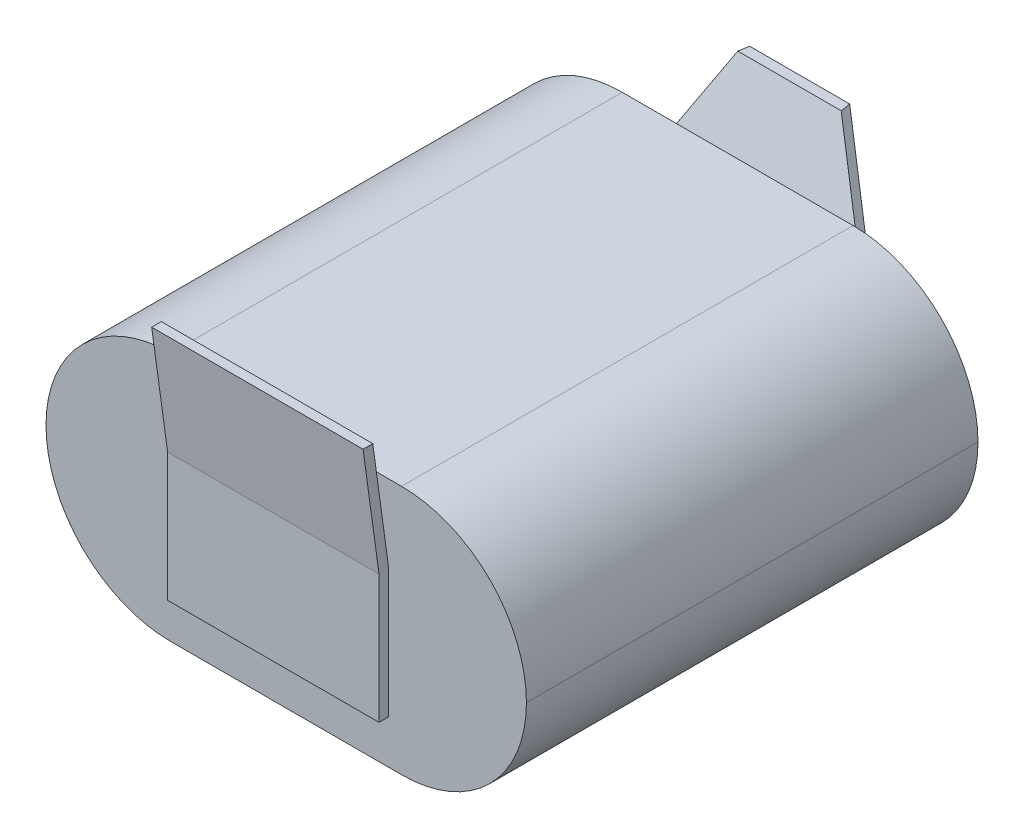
ISO-10303-21;
HEADER;
FILE_DESCRIPTION(('STEP AP214'),'2;1');
FILE_NAME('part.step','',(''),(''),'','','');
FILE_SCHEMA(('AUTOMOTIVE_DESIGN { 1 0 10303 214 1 1 1 1 }'));
ENDSEC;
DATA;
#1=APPLICATION_CONTEXT('core data for automotive mechanical design processes');
#2=APPLICATION_PROTOCOL_DEFINITION('international standard','automotive_design',2000,#1);
#3=PRODUCT_CONTEXT('',#1,'mechanical');
#4=PRODUCT('Part','Part','',(#3));
#5=PRODUCT_RELATED_PRODUCT_CATEGORY('part','',(#4));
#6=PRODUCT_DEFINITION_FORMATION('','',#4);
#7=PRODUCT_DEFINITION_CONTEXT('part definition',#1,'design');
#8=PRODUCT_DEFINITION('design','',#6,#7);
#9=PRODUCT_DEFINITION_SHAPE('','',#8);
#10=(LENGTH_UNIT() NAMED_UNIT(*) SI_UNIT(.MILLI.,.METRE.));
#11=(NAMED_UNIT(*) PLANE_ANGLE_UNIT() SI_UNIT($,.RADIAN.));
#12=(NAMED_UNIT(*) SI_UNIT($,.STERADIAN.) SOLID_ANGLE_UNIT());
#13=UNCERTAINTY_MEASURE_WITH_UNIT(LENGTH_MEASURE(1.E-05),#10,'distance_accuracy_value','');
#14=(GEOMETRIC_REPRESENTATION_CONTEXT(3) GLOBAL_UNCERTAINTY_ASSIGNED_CONTEXT((#13)) GLOBAL_UNIT_ASSIGNED_CONTEXT((#10,
#11,#12)) REPRESENTATION_CONTEXT('',''));
#15=CARTESIAN_POINT('',(0.,0.,0.));
#16=DIRECTION('',(0.,0.,1.));
#17=DIRECTION('',(1.,0.,0.));
#18=AXIS2_PLACEMENT_3D('',#15,#16,#17);
#19=CARTESIAN_POINT('',(3.17090192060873,-14.1,-23.5));
#20=DIRECTION('',(0.,0.,1.));
#21=DIRECTION('',(1.,0.,0.));
#22=AXIS2_PLACEMENT_3D('',#19,#20,#21);
#23=CYLINDRICAL_SURFACE('',#22,6.5);
#24=CARTESIAN_POINT('',(3.17090192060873,-14.1,0.));
#25=DIRECTION('',(0.,0.,1.));
#26=DIRECTION('',(1.,0.,0.));
#27=AXIS2_PLACEMENT_3D('',#24,#25,#26);
#28=CIRCLE('',#27,6.5);
#29=CARTESIAN_POINT('',(9.67090192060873,-14.1,0.));
#30=VERTEX_POINT('',#29);
#31=CARTESIAN_POINT('',(3.17090192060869,-7.6,0.));
#32=VERTEX_POINT('',#31);
#33=EDGE_CURVE('E274',#30,#32,#28,.T.);
#34=ORIENTED_EDGE('',*,*,#33,.F.);
#35=DIRECTION('',(0.,0.,1.));
#36=VECTOR('',#35,1.);
#37=CARTESIAN_POINT('',(9.67090192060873,-14.1,-23.5));
#38=LINE('',#37,#36);
#39=CARTESIAN_POINT('',(9.67090192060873,-14.1,-23.5));
#40=VERTEX_POINT('',#39);
#41=EDGE_CURVE('E11',#40,#30,#38,.T.);
#42=ORIENTED_EDGE('',*,*,#41,.F.);
#43=CARTESIAN_POINT('',(3.17090192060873,-14.1,-23.5));
#44=DIRECTION('',(0.,0.,1.));
#45=DIRECTION('',(1.,0.,0.));
#46=AXIS2_PLACEMENT_3D('',#43,#44,#45);
#47=CIRCLE('',#46,6.5);
#48=CARTESIAN_POINT('',(3.17090192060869,-7.6,-23.5));
#49=VERTEX_POINT('',#48);
#50=EDGE_CURVE('E275',#40,#49,#47,.T.);
#51=ORIENTED_EDGE('',*,*,#50,.T.);
#52=DIRECTION('',(0.,0.,1.));
#53=VECTOR('',#52,1.);
#54=CARTESIAN_POINT('',(3.17090192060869,-7.6,-23.5));
#55=LINE('',#54,#53);
#56=EDGE_CURVE('E35',#49,#32,#55,.T.);
#57=ORIENTED_EDGE('',*,*,#56,.T.);
#58=EDGE_LOOP('',(#34,#42,#51,#57));
#59=FACE_BOUND('',#58,.T.);
#60=ADVANCED_FACE('F32',(#59),#23,.T.);
#61=CARTESIAN_POINT('',(9.67090192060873,-14.11,-23.5));
#62=DIRECTION('',(1.,0.,0.));
#63=DIRECTION('',(0.,0.,-1.));
#64=AXIS2_PLACEMENT_3D('',#61,#62,#63);
#65=PLANE('',#64);
#66=DIRECTION('',(0.,1.,0.));
#67=VECTOR('',#66,1.);
#68=CARTESIAN_POINT('',(9.67090192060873,-14.11,0.));
#69=LINE('',#68,#67);
#70=CARTESIAN_POINT('',(9.67090192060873,-14.11,0.));
#71=VERTEX_POINT('',#70);
#72=EDGE_CURVE('E279',#71,#30,#69,.T.);
#73=ORIENTED_EDGE('',*,*,#72,.F.);
#74=DIRECTION('',(0.,0.,1.));
#75=VECTOR('',#74,1.);
#76=CARTESIAN_POINT('',(9.67090192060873,-14.11,-23.5));
#77=LINE('',#76,#75);
#78=CARTESIAN_POINT('',(9.67090192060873,-14.11,-23.5));
#79=VERTEX_POINT('',#78);
#80=EDGE_CURVE('E40',#79,#71,#77,.T.);
#81=ORIENTED_EDGE('',*,*,#80,.F.);
#82=DIRECTION('',(0.,1.,0.));
#83=VECTOR('',#82,1.);
#84=CARTESIAN_POINT('',(9.67090192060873,-14.11,-23.5));
#85=LINE('',#84,#83);
#86=EDGE_CURVE('E297',#79,#40,#85,.T.);
#87=ORIENTED_EDGE('',*,*,#86,.T.);
#88=ORIENTED_EDGE('',*,*,#41,.T.);
#89=EDGE_LOOP('',(#73,#81,#87,#88));
#90=FACE_BOUND('',#89,.T.);
#91=ADVANCED_FACE('F344',(#90),#65,.T.);
#92=CARTESIAN_POINT('',(3.18090192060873,-14.11,-23.5));
#93=DIRECTION('',(0.,0.,1.));
#94=DIRECTION('',(1.,0.,0.));
#95=AXIS2_PLACEMENT_3D('',#92,#93,#94);
#96=CYLINDRICAL_SURFACE('',#95,6.49);
#97=CARTESIAN_POINT('',(3.18090192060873,-14.11,0.));
#98=DIRECTION('',(0.,0.,1.));
#99=DIRECTION('',(1.,0.,0.));
#100=AXIS2_PLACEMENT_3D('',#97,#98,#99);
#101=CIRCLE('',#100,6.49);
#102=CARTESIAN_POINT('',(3.18090192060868,-20.6,0.));
#103=VERTEX_POINT('',#102);
#104=EDGE_CURVE('E317',#103,#71,#101,.T.);
#105=ORIENTED_EDGE('',*,*,#104,.F.);
#106=DIRECTION('',(0.,0.,1.));
#107=VECTOR('',#106,1.);
#108=CARTESIAN_POINT('',(3.18090192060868,-20.6,-23.5));
#109=LINE('',#108,#107);
#110=CARTESIAN_POINT('',(3.18090192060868,-20.6,-23.5));
#111=VERTEX_POINT('',#110);
#112=EDGE_CURVE('E323',#111,#103,#109,.T.);
#113=ORIENTED_EDGE('',*,*,#112,.F.);
#114=CARTESIAN_POINT('',(3.18090192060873,-14.11,-23.5));
#115=DIRECTION('',(0.,0.,1.));
#116=DIRECTION('',(1.,0.,0.));
#117=AXIS2_PLACEMENT_3D('',#114,#115,#116);
#118=CIRCLE('',#117,6.49);
#119=EDGE_CURVE('E294',#111,#79,#118,.T.);
#120=ORIENTED_EDGE('',*,*,#119,.T.);
#121=ORIENTED_EDGE('',*,*,#80,.T.);
#122=EDGE_LOOP('',(#105,#113,#120,#121));
#123=FACE_BOUND('',#122,.T.);
#124=ADVANCED_FACE('F365',(#123),#96,.T.);
#125=CARTESIAN_POINT('',(-8.82909807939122,-20.6,-23.5));
#126=DIRECTION('',(0.,-1.,0.));
#127=DIRECTION('',(0.,0.,-1.));
#128=AXIS2_PLACEMENT_3D('',#125,#126,#127);
#129=PLANE('',#128);
#130=DIRECTION('',(1.,0.,0.));
#131=VECTOR('',#130,1.);
#132=CARTESIAN_POINT('',(-8.82909807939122,-20.6,0.));
#133=LINE('',#132,#131);
#134=CARTESIAN_POINT('',(-8.82909807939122,-20.6,0.));
#135=VERTEX_POINT('',#134);
#136=EDGE_CURVE('E314',#135,#103,#133,.T.);
#137=ORIENTED_EDGE('',*,*,#136,.F.);
#138=DIRECTION('',(0.,0.,1.));
#139=VECTOR('',#138,1.);
#140=CARTESIAN_POINT('',(-8.82909807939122,-20.6,-23.5));
#141=LINE('',#140,#139);
#142=CARTESIAN_POINT('',(-8.82909807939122,-20.6,-23.5));
#143=VERTEX_POINT('',#142);
#144=EDGE_CURVE('E325',#143,#135,#141,.T.);
#145=ORIENTED_EDGE('',*,*,#144,.F.);
#146=DIRECTION('',(1.,0.,0.));
#147=VECTOR('',#146,1.);
#148=CARTESIAN_POINT('',(-8.82909807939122,-20.6,-23.5));
#149=LINE('',#148,#147);
#150=EDGE_CURVE('E291',#143,#111,#149,.T.);
#151=ORIENTED_EDGE('',*,*,#150,.T.);
#152=ORIENTED_EDGE('',*,*,#112,.T.);
#153=EDGE_LOOP('',(#137,#145,#151,#152));
#154=FACE_BOUND('',#153,.T.);
#155=ADVANCED_FACE('F363',(#154),#129,.T.);
#156=CARTESIAN_POINT('',(-8.82909807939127,-14.1,-23.5));
#157=DIRECTION('',(0.,0.,1.));
#158=DIRECTION('',(1.,0.,0.));
#159=AXIS2_PLACEMENT_3D('',#156,#157,#158);
#160=CYLINDRICAL_SURFACE('',#159,6.5);
#161=CARTESIAN_POINT('',(-8.82909807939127,-14.1,0.));
#162=DIRECTION('',(0.,0.,1.));
#163=DIRECTION('',(1.,0.,0.));
#164=AXIS2_PLACEMENT_3D('',#161,#162,#163);
#165=CIRCLE('',#164,6.5);
#166=CARTESIAN_POINT('',(-15.3290980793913,-14.1,0.));
#167=VERTEX_POINT('',#166);
#168=EDGE_CURVE('E311',#167,#135,#165,.T.);
#169=ORIENTED_EDGE('',*,*,#168,.F.);
#170=DIRECTION('',(0.,0.,1.));
#171=VECTOR('',#170,1.);
#172=CARTESIAN_POINT('',(-15.3290980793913,-14.1,-23.5));
#173=LINE('',#172,#171);
#174=CARTESIAN_POINT('',(-15.3290980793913,-14.1,-23.5));
#175=VERTEX_POINT('',#174);
#176=EDGE_CURVE('E327',#175,#167,#173,.T.);
#177=ORIENTED_EDGE('',*,*,#176,.F.);
#178=CARTESIAN_POINT('',(-8.82909807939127,-14.1,-23.5));
#179=DIRECTION('',(0.,0.,1.));
#180=DIRECTION('',(1.,0.,0.));
#181=AXIS2_PLACEMENT_3D('',#178,#179,#180);
#182=CIRCLE('',#181,6.5);
#183=EDGE_CURVE('E288',#175,#143,#182,.T.);
#184=ORIENTED_EDGE('',*,*,#183,.T.);
#185=ORIENTED_EDGE('',*,*,#144,.T.);
#186=EDGE_LOOP('',(#169,#177,#184,#185));
#187=FACE_BOUND('',#186,.T.);
#188=ADVANCED_FACE('F359',(#187),#160,.T.);
#189=CARTESIAN_POINT('',(-15.3290980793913,-14.1,-23.5));
#190=DIRECTION('',(-1.,0.,0.));
#191=DIRECTION('',(0.,0.,1.));
#192=AXIS2_PLACEMENT_3D('',#189,#190,#191);
#193=PLANE('',#192);
#194=DIRECTION('',(0.,-1.,0.));
#195=VECTOR('',#194,1.);
#196=CARTESIAN_POINT('',(-15.3290980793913,-14.1,0.));
#197=LINE('',#196,#195);
#198=CARTESIAN_POINT('',(-15.3290980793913,-14.09,0.));
#199=VERTEX_POINT('',#198);
#200=EDGE_CURVE('E308',#199,#167,#197,.T.);
#201=ORIENTED_EDGE('',*,*,#200,.F.);
#202=DIRECTION('',(0.,0.,1.));
#203=VECTOR('',#202,1.);
#204=CARTESIAN_POINT('',(-15.3290980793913,-14.09,-23.5));
#205=LINE('',#204,#203);
#206=CARTESIAN_POINT('',(-15.3290980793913,-14.09,-23.5));
#207=VERTEX_POINT('',#206);
#208=EDGE_CURVE('E329',#207,#199,#205,.T.);
#209=ORIENTED_EDGE('',*,*,#208,.F.);
#210=DIRECTION('',(0.,-1.,0.));
#211=VECTOR('',#210,1.);
#212=CARTESIAN_POINT('',(-15.3290980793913,-14.1,-23.5));
#213=LINE('',#212,#211);
#214=EDGE_CURVE('E285',#207,#175,#213,.T.);
#215=ORIENTED_EDGE('',*,*,#214,.T.);
#216=ORIENTED_EDGE('',*,*,#176,.T.);
#217=EDGE_LOOP('',(#201,#209,#215,#216));
#218=FACE_BOUND('',#217,.T.);
#219=ADVANCED_FACE('F357',(#218),#193,.T.);
#220=CARTESIAN_POINT('',(-8.83909807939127,-14.09,-23.5));
#221=DIRECTION('',(0.,0.,1.));
#222=DIRECTION('',(1.,0.,0.));
#223=AXIS2_PLACEMENT_3D('',#220,#221,#222);
#224=CYLINDRICAL_SURFACE('',#223,6.49);
#225=CARTESIAN_POINT('',(-8.83909807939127,-14.09,0.));
#226=DIRECTION('',(0.,0.,1.));
#227=DIRECTION('',(1.,0.,0.));
#228=AXIS2_PLACEMENT_3D('',#225,#226,#227);
#229=CIRCLE('',#228,6.49);
#230=CARTESIAN_POINT('',(-8.83909807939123,-7.6,0.));
#231=VERTEX_POINT('',#230);
#232=EDGE_CURVE('E305',#231,#199,#229,.T.);
#233=ORIENTED_EDGE('',*,*,#232,.F.);
#234=DIRECTION('',(0.,0.,1.));
#235=VECTOR('',#234,1.);
#236=CARTESIAN_POINT('',(-8.83909807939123,-7.6,-23.5));
#237=LINE('',#236,#235);
#238=CARTESIAN_POINT('',(-8.83909807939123,-7.6,-23.5));
#239=VERTEX_POINT('',#238);
#240=EDGE_CURVE('E330',#239,#231,#237,.T.);
#241=ORIENTED_EDGE('',*,*,#240,.F.);
#242=CARTESIAN_POINT('',(-8.83909807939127,-14.09,-23.5));
#243=DIRECTION('',(0.,0.,1.));
#244=DIRECTION('',(1.,0.,0.));
#245=AXIS2_PLACEMENT_3D('',#242,#243,#244);
#246=CIRCLE('',#245,6.49);
#247=EDGE_CURVE('E282',#239,#207,#246,.T.);
#248=ORIENTED_EDGE('',*,*,#247,.T.);
#249=ORIENTED_EDGE('',*,*,#208,.T.);
#250=EDGE_LOOP('',(#233,#241,#248,#249));
#251=FACE_BOUND('',#250,.T.);
#252=ADVANCED_FACE('F353',(#251),#224,.T.);
#253=CARTESIAN_POINT('',(-8.83909807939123,-7.6,-23.5));
#254=DIRECTION('',(0.,1.,0.));
#255=DIRECTION('',(0.,0.,1.));
#256=AXIS2_PLACEMENT_3D('',#253,#254,#255);
#257=PLANE('',#256);
#258=DIRECTION('',(-1.,0.,0.));
#259=VECTOR('',#258,1.);
#260=CARTESIAN_POINT('',(-8.83909807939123,-7.6,0.));
#261=LINE('',#260,#259);
#262=EDGE_CURVE('E302',#32,#231,#261,.T.);
#263=ORIENTED_EDGE('',*,*,#262,.F.);
#264=ORIENTED_EDGE('',*,*,#56,.F.);
#265=DIRECTION('',(-1.,0.,0.));
#266=VECTOR('',#265,1.);
#267=CARTESIAN_POINT('',(-8.83909807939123,-7.6,-23.5));
#268=LINE('',#267,#266);
#269=EDGE_CURVE('E278',#49,#239,#268,.T.);
#270=ORIENTED_EDGE('',*,*,#269,.T.);
#271=ORIENTED_EDGE('',*,*,#240,.T.);
#272=EDGE_LOOP('',(#263,#264,#270,#271));
#273=FACE_BOUND('',#272,.T.);
#274=ADVANCED_FACE('F338',(#273),#257,.T.);
#275=CARTESIAN_POINT('',(3.17090192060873,-14.1,-23.5));
#276=DIRECTION('',(0.,0.,1.));
#277=DIRECTION('',(1.,0.,0.));
#278=AXIS2_PLACEMENT_3D('',#275,#276,#277);
#279=PLANE('',#278);
#280=DIRECTION('',(-1.,0.,0.));
#281=VECTOR('',#280,1.);
#282=CARTESIAN_POINT('',(2.5,-18.3247245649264,-23.5));
#283=LINE('',#282,#281);
#284=CARTESIAN_POINT('',(2.5,-18.3247245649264,-23.5));
#285=VERTEX_POINT('',#284);
#286=CARTESIAN_POINT('',(-8.5,-18.3247245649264,-23.5));
#287=VERTEX_POINT('',#286);
#288=EDGE_CURVE('E227',#285,#287,#283,.T.);
#289=ORIENTED_EDGE('',*,*,#288,.F.);
#290=DIRECTION('',(0.,-1.,0.));
#291=VECTOR('',#290,1.);
#292=CARTESIAN_POINT('',(2.5,-18.3247245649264,-23.5));
#293=LINE('',#292,#291);
#294=CARTESIAN_POINT('',(2.5,-14.0273890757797,-23.5));
#295=VERTEX_POINT('',#294);
#296=EDGE_CURVE('E204',#295,#285,#293,.T.);
#297=ORIENTED_EDGE('',*,*,#296,.F.);
#298=DIRECTION('',(-1.,0.,0.));
#299=VECTOR('',#298,1.);
#300=CARTESIAN_POINT('',(2.5,-14.0273890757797,-23.5));
#301=LINE('',#300,#299);
#302=CARTESIAN_POINT('',(-8.5,-14.0273890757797,-23.5));
#303=VERTEX_POINT('',#302);
#304=EDGE_CURVE('E214',#295,#303,#301,.T.);
#305=ORIENTED_EDGE('',*,*,#304,.T.);
#306=DIRECTION('',(0.,-1.,0.));
#307=VECTOR('',#306,1.);
#308=CARTESIAN_POINT('',(-8.5,-18.3247245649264,-23.5));
#309=LINE('',#308,#307);
#310=EDGE_CURVE('E203',#303,#287,#309,.T.);
#311=ORIENTED_EDGE('',*,*,#310,.T.);
#312=EDGE_LOOP('',(#289,#297,#305,#311));
#313=FACE_BOUND('',#312,.T.);
#314=ORIENTED_EDGE('',*,*,#50,.F.);
#315=ORIENTED_EDGE('',*,*,#86,.F.);
#316=ORIENTED_EDGE('',*,*,#119,.F.);
#317=ORIENTED_EDGE('',*,*,#150,.F.);
#318=ORIENTED_EDGE('',*,*,#183,.F.);
#319=ORIENTED_EDGE('',*,*,#214,.F.);
#320=ORIENTED_EDGE('',*,*,#247,.F.);
#321=ORIENTED_EDGE('',*,*,#269,.F.);
#322=EDGE_LOOP('',(#314,#315,#316,#317,#318,#319,#320,#321));
#323=FACE_BOUND('',#322,.T.);
#324=ADVANCED_FACE('F347',(#313,#323),#279,.F.);
#325=CARTESIAN_POINT('',(3.17090192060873,-14.1,0.));
#326=DIRECTION('',(0.,0.,1.));
#327=DIRECTION('',(1.,0.,0.));
#328=AXIS2_PLACEMENT_3D('',#325,#326,#327);
#329=PLANE('',#328);
#330=DIRECTION('',(0.,1.,0.));
#331=VECTOR('',#330,1.);
#332=CARTESIAN_POINT('',(2.5,-18.3247245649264,0.));
#333=LINE('',#332,#331);
#334=CARTESIAN_POINT('',(2.5,-18.3247245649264,0.));
#335=VERTEX_POINT('',#334);
#336=CARTESIAN_POINT('',(2.5,-11.6078727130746,0.));
#337=VERTEX_POINT('',#336);
#338=EDGE_CURVE('E233',#335,#337,#333,.T.);
#339=ORIENTED_EDGE('',*,*,#338,.F.);
#340=DIRECTION('',(-1.,0.,0.));
#341=VECTOR('',#340,1.);
#342=CARTESIAN_POINT('',(2.5,-18.3247245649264,0.));
#343=LINE('',#342,#341);
#344=CARTESIAN_POINT('',(-8.5,-18.3247245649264,0.));
#345=VERTEX_POINT('',#344);
#346=EDGE_CURVE('E271',#335,#345,#343,.T.);
#347=ORIENTED_EDGE('',*,*,#346,.T.);
#348=DIRECTION('',(0.,1.,0.));
#349=VECTOR('',#348,1.);
#350=CARTESIAN_POINT('',(-8.5,-18.3247245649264,0.));
#351=LINE('',#350,#349);
#352=CARTESIAN_POINT('',(-8.5,-11.6078727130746,0.));
#353=VERTEX_POINT('',#352);
#354=EDGE_CURVE('E247',#345,#353,#351,.T.);
#355=ORIENTED_EDGE('',*,*,#354,.T.);
#356=DIRECTION('',(-1.,0.,0.));
#357=VECTOR('',#356,1.);
#358=CARTESIAN_POINT('',(2.5,-11.6078727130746,0.));
#359=LINE('',#358,#357);
#360=EDGE_CURVE('E268',#337,#353,#359,.T.);
#361=ORIENTED_EDGE('',*,*,#360,.F.);
#362=EDGE_LOOP('',(#339,#347,#355,#361));
#363=FACE_BOUND('',#362,.T.);
#364=ORIENTED_EDGE('',*,*,#33,.T.);
#365=ORIENTED_EDGE('',*,*,#262,.T.);
#366=ORIENTED_EDGE('',*,*,#232,.T.);
#367=ORIENTED_EDGE('',*,*,#200,.T.);
#368=ORIENTED_EDGE('',*,*,#168,.T.);
#369=ORIENTED_EDGE('',*,*,#136,.T.);
#370=ORIENTED_EDGE('',*,*,#104,.T.);
#371=ORIENTED_EDGE('',*,*,#72,.T.);
#372=EDGE_LOOP('',(#364,#365,#366,#367,#368,#369,#370,#371));
#373=FACE_BOUND('',#372,.T.);
#374=ADVANCED_FACE('F340',(#363,#373),#329,.T.);
#375=CARTESIAN_POINT('',(2.5,-18.3247245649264,0.5));
#376=DIRECTION('',(0.,1.,0.));
#377=DIRECTION('',(0.,0.,1.));
#378=AXIS2_PLACEMENT_3D('',#375,#376,#377);
#379=PLANE('',#378);
#380=DIRECTION('',(0.,0.,-1.));
#381=VECTOR('',#380,1.);
#382=CARTESIAN_POINT('',(-8.5,-18.3247245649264,0.5));
#383=LINE('',#382,#381);
#384=CARTESIAN_POINT('',(-8.5,-18.3247245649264,0.5));
#385=VERTEX_POINT('',#384);
#386=EDGE_CURVE('E230',#385,#345,#383,.T.);
#387=ORIENTED_EDGE('',*,*,#386,.T.);
#388=ORIENTED_EDGE('',*,*,#346,.F.);
#389=DIRECTION('',(0.,0.,-1.));
#390=VECTOR('',#389,1.);
#391=CARTESIAN_POINT('',(2.5,-18.3247245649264,0.5));
#392=LINE('',#391,#390);
#393=CARTESIAN_POINT('',(2.5,-18.3247245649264,0.5));
#394=VERTEX_POINT('',#393);
#395=EDGE_CURVE('E231',#394,#335,#392,.T.);
#396=ORIENTED_EDGE('',*,*,#395,.F.);
#397=DIRECTION('',(-1.,0.,0.));
#398=VECTOR('',#397,1.);
#399=CARTESIAN_POINT('',(2.5,-18.3247245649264,0.5));
#400=LINE('',#399,#398);
#401=EDGE_CURVE('E244',#394,#385,#400,.T.);
#402=ORIENTED_EDGE('',*,*,#401,.T.);
#403=EDGE_LOOP('',(#387,#388,#396,#402));
#404=FACE_BOUND('',#403,.T.);
#405=ADVANCED_FACE('F433',(#404),#379,.F.);
#406=CARTESIAN_POINT('',(2.5,-11.6078727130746,0.));
#407=DIRECTION('',(0.,-0.135914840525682,0.990720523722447));
#408=DIRECTION('',(0.,-0.990720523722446,-0.135914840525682));
#409=AXIS2_PLACEMENT_3D('',#406,#407,#408);
#410=PLANE('',#409);
#411=DIRECTION('',(0.,0.990720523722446,0.135914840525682));
#412=VECTOR('',#411,1.);
#413=CARTESIAN_POINT('',(-8.5,-11.6078727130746,0.));
#414=LINE('',#413,#412);
#415=CARTESIAN_POINT('',(-8.5,-5.6,0.824207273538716));
#416=VERTEX_POINT('',#415);
#417=EDGE_CURVE('E250',#353,#416,#414,.T.);
#418=ORIENTED_EDGE('',*,*,#417,.T.);
#419=DIRECTION('',(-1.,0.,0.));
#420=VECTOR('',#419,1.);
#421=CARTESIAN_POINT('',(2.5,-5.6,0.824207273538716));
#422=LINE('',#421,#420);
#423=CARTESIAN_POINT('',(2.5,-5.6,0.824207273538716));
#424=VERTEX_POINT('',#423);
#425=EDGE_CURVE('E265',#424,#416,#422,.T.);
#426=ORIENTED_EDGE('',*,*,#425,.F.);
#427=DIRECTION('',(0.,0.990720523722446,0.135914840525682));
#428=VECTOR('',#427,1.);
#429=CARTESIAN_POINT('',(2.5,-11.6078727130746,0.));
#430=LINE('',#429,#428);
#431=EDGE_CURVE('E236',#337,#424,#430,.T.);
#432=ORIENTED_EDGE('',*,*,#431,.F.);
#433=ORIENTED_EDGE('',*,*,#360,.T.);
#434=EDGE_LOOP('',(#418,#426,#432,#433));
#435=FACE_BOUND('',#434,.T.);
#436=ADVANCED_FACE('F443',(#435),#410,.F.);
#437=CARTESIAN_POINT('',(2.5,-5.6,0.824207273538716));
#438=DIRECTION('',(0.,-1.,0.));
#439=DIRECTION('',(0.,0.,-1.));
#440=AXIS2_PLACEMENT_3D('',#437,#438,#439);
#441=PLANE('',#440);
#442=DIRECTION('',(0.,0.,1.));
#443=VECTOR('',#442,1.);
#444=CARTESIAN_POINT('',(-8.5,-5.6,0.824207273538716));
#445=LINE('',#444,#443);
#446=CARTESIAN_POINT('',(-8.5,-5.6,1.32889046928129));
#447=VERTEX_POINT('',#446);
#448=EDGE_CURVE('E252',#416,#447,#445,.T.);
#449=ORIENTED_EDGE('',*,*,#448,.T.);
#450=DIRECTION('',(-1.,0.,0.));
#451=VECTOR('',#450,1.);
#452=CARTESIAN_POINT('',(2.5,-5.6,1.32889046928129));
#453=LINE('',#452,#451);
#454=CARTESIAN_POINT('',(2.5,-5.6,1.32889046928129));
#455=VERTEX_POINT('',#454);
#456=EDGE_CURVE('E262',#455,#447,#453,.T.);
#457=ORIENTED_EDGE('',*,*,#456,.F.);
#458=DIRECTION('',(0.,0.,1.));
#459=VECTOR('',#458,1.);
#460=CARTESIAN_POINT('',(2.5,-5.6,0.824207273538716));
#461=LINE('',#460,#459);
#462=EDGE_CURVE('E238',#424,#455,#461,.T.);
#463=ORIENTED_EDGE('',*,*,#462,.F.);
#464=ORIENTED_EDGE('',*,*,#425,.T.);
#465=EDGE_LOOP('',(#449,#457,#463,#464));
#466=FACE_BOUND('',#465,.T.);
#467=ADVANCED_FACE('F453',(#466),#441,.F.);
#468=CARTESIAN_POINT('',(2.5,-11.6420098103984,0.5));
#469=DIRECTION('',(0.,0.135914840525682,-0.990720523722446));
#470=DIRECTION('',(0.,0.990720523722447,0.135914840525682));
#471=AXIS2_PLACEMENT_3D('',#468,#469,#470);
#472=PLANE('',#471);
#473=DIRECTION('',(0.,-0.990720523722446,-0.135914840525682));
#474=VECTOR('',#473,1.);
#475=CARTESIAN_POINT('',(-8.5,-11.6420098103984,0.5));
#476=LINE('',#475,#474);
#477=CARTESIAN_POINT('',(-8.5,-11.6420098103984,0.5));
#478=VERTEX_POINT('',#477);
#479=EDGE_CURVE('E254',#447,#478,#476,.T.);
#480=ORIENTED_EDGE('',*,*,#479,.T.);
#481=DIRECTION('',(-1.,0.,0.));
#482=VECTOR('',#481,1.);
#483=CARTESIAN_POINT('',(2.5,-11.6420098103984,0.5));
#484=LINE('',#483,#482);
#485=CARTESIAN_POINT('',(2.5,-11.6420098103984,0.5));
#486=VERTEX_POINT('',#485);
#487=EDGE_CURVE('E259',#486,#478,#484,.T.);
#488=ORIENTED_EDGE('',*,*,#487,.F.);
#489=DIRECTION('',(0.,-0.990720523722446,-0.135914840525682));
#490=VECTOR('',#489,1.);
#491=CARTESIAN_POINT('',(2.5,-11.6420098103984,0.5));
#492=LINE('',#491,#490);
#493=EDGE_CURVE('E240',#455,#486,#492,.T.);
#494=ORIENTED_EDGE('',*,*,#493,.F.);
#495=ORIENTED_EDGE('',*,*,#456,.T.);
#496=EDGE_LOOP('',(#480,#488,#494,#495));
#497=FACE_BOUND('',#496,.T.);
#498=ADVANCED_FACE('F463',(#497),#472,.F.);
#499=CARTESIAN_POINT('',(2.5,-18.3247245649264,0.5));
#500=DIRECTION('',(0.,0.,-1.));
#501=DIRECTION('',(-1.,0.,0.));
#502=AXIS2_PLACEMENT_3D('',#499,#500,#501);
#503=PLANE('',#502);
#504=DIRECTION('',(0.,-1.,0.));
#505=VECTOR('',#504,1.);
#506=CARTESIAN_POINT('',(-8.5,-18.3247245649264,0.5));
#507=LINE('',#506,#505);
#508=EDGE_CURVE('E234',#478,#385,#507,.T.);
#509=ORIENTED_EDGE('',*,*,#508,.T.);
#510=ORIENTED_EDGE('',*,*,#401,.F.);
#511=DIRECTION('',(0.,-1.,0.));
#512=VECTOR('',#511,1.);
#513=CARTESIAN_POINT('',(2.5,-18.3247245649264,0.5));
#514=LINE('',#513,#512);
#515=EDGE_CURVE('E242',#486,#394,#514,.T.);
#516=ORIENTED_EDGE('',*,*,#515,.F.);
#517=ORIENTED_EDGE('',*,*,#487,.T.);
#518=EDGE_LOOP('',(#509,#510,#516,#517));
#519=FACE_BOUND('',#518,.T.);
#520=ADVANCED_FACE('F473',(#519),#503,.F.);
#521=CARTESIAN_POINT('',(2.5,-18.3247245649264,0.));
#522=DIRECTION('',(1.,0.,0.));
#523=DIRECTION('',(0.,0.,-1.));
#524=AXIS2_PLACEMENT_3D('',#521,#522,#523);
#525=PLANE('',#524);
#526=ORIENTED_EDGE('',*,*,#395,.T.);
#527=ORIENTED_EDGE('',*,*,#338,.T.);
#528=ORIENTED_EDGE('',*,*,#431,.T.);
#529=ORIENTED_EDGE('',*,*,#462,.T.);
#530=ORIENTED_EDGE('',*,*,#493,.T.);
#531=ORIENTED_EDGE('',*,*,#515,.T.);
#532=EDGE_LOOP('',(#526,#527,#528,#529,#530,#531));
#533=FACE_BOUND('',#532,.T.);
#534=ADVANCED_FACE('F483',(#533),#525,.T.);
#535=CARTESIAN_POINT('',(-8.5,-18.3247245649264,0.));
#536=DIRECTION('',(1.,0.,0.));
#537=DIRECTION('',(0.,0.,-1.));
#538=AXIS2_PLACEMENT_3D('',#535,#536,#537);
#539=PLANE('',#538);
#540=ORIENTED_EDGE('',*,*,#386,.F.);
#541=ORIENTED_EDGE('',*,*,#508,.F.);
#542=ORIENTED_EDGE('',*,*,#479,.F.);
#543=ORIENTED_EDGE('',*,*,#448,.F.);
#544=ORIENTED_EDGE('',*,*,#417,.F.);
#545=ORIENTED_EDGE('',*,*,#354,.F.);
#546=EDGE_LOOP('',(#540,#541,#542,#543,#544,#545));
#547=FACE_BOUND('',#546,.T.);
#548=ADVANCED_FACE('F493',(#547),#539,.F.);
#549=CARTESIAN_POINT('',(2.5,-18.3247245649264,-23.5));
#550=DIRECTION('',(0.,1.,0.));
#551=DIRECTION('',(0.,0.,1.));
#552=AXIS2_PLACEMENT_3D('',#549,#550,#551);
#553=PLANE('',#552);
#554=DIRECTION('',(0.,0.,-1.));
#555=VECTOR('',#554,1.);
#556=CARTESIAN_POINT('',(-8.5,-18.3247245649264,-23.5));
#557=LINE('',#556,#555);
#558=CARTESIAN_POINT('',(-8.5,-18.3247245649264,-24.));
#559=VERTEX_POINT('',#558);
#560=EDGE_CURVE('E610',#287,#559,#557,.T.);
#561=ORIENTED_EDGE('',*,*,#560,.T.);
#562=DIRECTION('',(-1.,0.,0.));
#563=VECTOR('',#562,1.);
#564=CARTESIAN_POINT('',(2.5,-18.3247245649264,-24.));
#565=LINE('',#564,#563);
#566=CARTESIAN_POINT('',(2.5,-18.3247245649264,-24.));
#567=VERTEX_POINT('',#566);
#568=EDGE_CURVE('E224',#567,#559,#565,.T.);
#569=ORIENTED_EDGE('',*,*,#568,.F.);
#570=DIRECTION('',(0.,0.,-1.));
#571=VECTOR('',#570,1.);
#572=CARTESIAN_POINT('',(2.5,-18.3247245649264,-23.5));
#573=LINE('',#572,#571);
#574=EDGE_CURVE('E208',#285,#567,#573,.T.);
#575=ORIENTED_EDGE('',*,*,#574,.F.);
#576=ORIENTED_EDGE('',*,*,#288,.T.);
#577=EDGE_LOOP('',(#561,#569,#575,#576));
#578=FACE_BOUND('',#577,.T.);
#579=ADVANCED_FACE('F503',(#578),#553,.F.);
#580=CARTESIAN_POINT('',(2.5,-18.3247245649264,-24.));
#581=DIRECTION('',(0.,0.,1.));
#582=DIRECTION('',(1.,0.,0.));
#583=AXIS2_PLACEMENT_3D('',#580,#581,#582);
#584=PLANE('',#583);
#585=DIRECTION('',(0.,1.,0.));
#586=VECTOR('',#585,1.);
#587=CARTESIAN_POINT('',(-8.5,-18.3247245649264,-24.));
#588=LINE('',#587,#586);
#589=CARTESIAN_POINT('',(-8.5,-14.11,-24.));
#590=VERTEX_POINT('',#589);
#591=EDGE_CURVE('E210',#559,#590,#588,.T.);
#592=ORIENTED_EDGE('',*,*,#591,.T.);
#593=DIRECTION('',(-1.,0.,0.));
#594=VECTOR('',#593,1.);
#595=CARTESIAN_POINT('',(2.5,-14.11,-24.));
#596=LINE('',#595,#594);
#597=CARTESIAN_POINT('',(2.5,-14.11,-24.));
#598=VERTEX_POINT('',#597);
#599=EDGE_CURVE('E221',#598,#590,#596,.T.);
#600=ORIENTED_EDGE('',*,*,#599,.F.);
#601=DIRECTION('',(0.,1.,0.));
#602=VECTOR('',#601,1.);
#603=CARTESIAN_POINT('',(2.5,-18.3247245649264,-24.));
#604=LINE('',#603,#602);
#605=EDGE_CURVE('E605',#567,#598,#604,.T.);
#606=ORIENTED_EDGE('',*,*,#605,.F.);
#607=ORIENTED_EDGE('',*,*,#568,.T.);
#608=EDGE_LOOP('',(#592,#600,#606,#607));
#609=FACE_BOUND('',#608,.T.);
#610=ADVANCED_FACE('F520',(#609),#584,.F.);
#611=CARTESIAN_POINT('',(2.5,-14.11,-24.));
#612=DIRECTION('',(0.,0.321662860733,0.946854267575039));
#613=DIRECTION('',(0.,-0.946854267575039,0.321662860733));
#614=AXIS2_PLACEMENT_3D('',#611,#612,#613);
#615=PLANE('',#614);
#616=DIRECTION('',(-1.,0.,0.));
#617=VECTOR('',#616,1.);
#618=CARTESIAN_POINT('',(2.5,-5.6,-26.8909949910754));
#619=LINE('',#618,#617);
#620=CARTESIAN_POINT('',(-0.39640752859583,-5.6,-26.8909949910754));
#621=VERTEX_POINT('',#620);
#622=CARTESIAN_POINT('',(-5.60359247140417,-5.6,-26.8909949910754));
#623=VERTEX_POINT('',#622);
#624=EDGE_CURVE('E218',#621,#623,#619,.T.);
#625=ORIENTED_EDGE('',*,*,#624,.F.);
#626=DIRECTION('',(-0.45498195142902,0.843174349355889,-0.286440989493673));
#627=VECTOR('',#626,1.);
#628=CARTESIAN_POINT('',(-0.645397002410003,-5.13857172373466,-27.0477502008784));
#629=LINE('',#628,#627);
#630=CARTESIAN_POINT('',(2.5,-10.9676338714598,-25.0675164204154));
#631=VERTEX_POINT('',#630);
#632=EDGE_CURVE('E198',#631,#621,#629,.T.);
#633=ORIENTED_EDGE('',*,*,#632,.F.);
#634=DIRECTION('',(0.,0.946854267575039,-0.321662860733));
#635=VECTOR('',#634,1.);
#636=CARTESIAN_POINT('',(2.5,-14.11,-24.));
#637=LINE('',#636,#635);
#638=EDGE_CURVE('E600',#598,#631,#637,.T.);
#639=ORIENTED_EDGE('',*,*,#638,.F.);
#640=ORIENTED_EDGE('',*,*,#599,.T.);
#641=DIRECTION('',(0.,0.946854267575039,-0.321662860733));
#642=VECTOR('',#641,1.);
#643=CARTESIAN_POINT('',(-8.5,-14.11,-24.));
#644=LINE('',#643,#642);
#645=CARTESIAN_POINT('',(-8.5,-10.9676338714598,-25.0675164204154));
#646=VERTEX_POINT('',#645);
#647=EDGE_CURVE('E205',#590,#646,#644,.T.);
#648=ORIENTED_EDGE('',*,*,#647,.T.);
#649=DIRECTION('',(-0.45498195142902,-0.843174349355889,0.286440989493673));
#650=VECTOR('',#649,1.);
#651=CARTESIAN_POINT('',(-5.35460299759,-5.13857172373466,-27.0477502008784));
#652=LINE('',#651,#650);
#653=EDGE_CURVE('E56',#623,#646,#652,.T.);
#654=ORIENTED_EDGE('',*,*,#653,.F.);
#655=EDGE_LOOP('',(#625,#633,#639,#640,#648,#654));
#656=FACE_BOUND('',#655,.T.);
#657=ADVANCED_FACE('F530',(#656),#615,.F.);
#658=CARTESIAN_POINT('',(2.5,-5.6,-26.8909949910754));
#659=DIRECTION('',(0.,-1.,0.));
#660=DIRECTION('',(0.,0.,-1.));
#661=AXIS2_PLACEMENT_3D('',#658,#659,#660);
#662=PLANE('',#661);
#663=DIRECTION('',(-1.,0.,0.));
#664=VECTOR('',#663,1.);
#665=CARTESIAN_POINT('',(2.5,-5.6,-26.3629306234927));
#666=LINE('',#665,#664);
#667=CARTESIAN_POINT('',(-0.309621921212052,-5.6,-26.3629306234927));
#668=VERTEX_POINT('',#667);
#669=CARTESIAN_POINT('',(-5.69037807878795,-5.6,-26.3629306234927));
#670=VERTEX_POINT('',#669);
#671=EDGE_CURVE('E197',#668,#670,#666,.T.);
#672=ORIENTED_EDGE('',*,*,#671,.F.);
#673=DIRECTION('',(-0.162171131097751,0.,-0.986762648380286));
#674=VECTOR('',#673,1.);
#675=CARTESIAN_POINT('',(-0.320233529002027,-5.6,-26.4274990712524));
#676=LINE('',#675,#674);
#677=EDGE_CURVE('E611',#668,#621,#676,.T.);
#678=ORIENTED_EDGE('',*,*,#677,.T.);
#679=ORIENTED_EDGE('',*,*,#624,.T.);
#680=DIRECTION('',(-0.162171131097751,0.,0.986762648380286));
#681=VECTOR('',#680,1.);
#682=CARTESIAN_POINT('',(-5.39047223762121,-5.6,-28.1877676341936));
#683=LINE('',#682,#681);
#684=EDGE_CURVE('E602',#623,#670,#683,.T.);
#685=ORIENTED_EDGE('',*,*,#684,.T.);
#686=EDGE_LOOP('',(#672,#678,#679,#685));
#687=FACE_BOUND('',#686,.T.);
#688=ADVANCED_FACE('F540',(#687),#662,.F.);
#689=CARTESIAN_POINT('',(2.5,-14.0273890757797,-23.5));
#690=DIRECTION('',(0.,-0.321662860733,-0.946854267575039));
#691=DIRECTION('',(0.,0.946854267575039,-0.321662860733));
#692=AXIS2_PLACEMENT_3D('',#689,#690,#691);
#693=PLANE('',#692);
#694=DIRECTION('',(0.,-0.946854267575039,0.321662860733));
#695=VECTOR('',#694,1.);
#696=CARTESIAN_POINT('',(2.5,-14.0273890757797,-23.5));
#697=LINE('',#696,#695);
#698=CARTESIAN_POINT('',(2.5,-10.8068024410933,-24.5940892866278));
#699=VERTEX_POINT('',#698);
#700=EDGE_CURVE('E216',#699,#295,#697,.T.);
#701=ORIENTED_EDGE('',*,*,#700,.F.);
#702=DIRECTION('',(-0.45498195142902,0.843174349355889,-0.286440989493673));
#703=VECTOR('',#702,1.);
#704=CARTESIAN_POINT('',(-0.645397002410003,-4.97774029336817,-26.5743230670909));
#705=LINE('',#704,#703);
#706=EDGE_CURVE('E48',#699,#668,#705,.T.);
#707=ORIENTED_EDGE('',*,*,#706,.T.);
#708=ORIENTED_EDGE('',*,*,#671,.T.);
#709=DIRECTION('',(-0.45498195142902,-0.843174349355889,0.286440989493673));
#710=VECTOR('',#709,1.);
#711=CARTESIAN_POINT('',(-5.35460299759,-4.97774029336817,-26.5743230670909));
#712=LINE('',#711,#710);
#713=CARTESIAN_POINT('',(-8.5,-10.8068024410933,-24.5940892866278));
#714=VERTEX_POINT('',#713);
#715=EDGE_CURVE('E181',#670,#714,#712,.T.);
#716=ORIENTED_EDGE('',*,*,#715,.T.);
#717=DIRECTION('',(0.,-0.946854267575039,0.321662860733));
#718=VECTOR('',#717,1.);
#719=CARTESIAN_POINT('',(-8.5,-14.0273890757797,-23.5));
#720=LINE('',#719,#718);
#721=EDGE_CURVE('E194',#714,#303,#720,.T.);
#722=ORIENTED_EDGE('',*,*,#721,.T.);
#723=ORIENTED_EDGE('',*,*,#304,.F.);
#724=EDGE_LOOP('',(#701,#707,#708,#716,#722,#723));
#725=FACE_BOUND('',#724,.T.);
#726=ADVANCED_FACE('F192',(#725),#693,.F.);
#727=CARTESIAN_POINT('',(2.5,-5.6,-23.5));
#728=DIRECTION('',(1.,0.,0.));
#729=DIRECTION('',(0.,0.,-1.));
#730=AXIS2_PLACEMENT_3D('',#727,#728,#729);
#731=PLANE('',#730);
#732=DIRECTION('',(0.,-0.321662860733,-0.946854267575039));
#733=VECTOR('',#732,1.);
#734=CARTESIAN_POINT('',(2.5,-10.8068024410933,-24.5940892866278));
#735=LINE('',#734,#733);
#736=EDGE_CURVE('E187',#699,#631,#735,.T.);
#737=ORIENTED_EDGE('',*,*,#736,.F.);
#738=ORIENTED_EDGE('',*,*,#700,.T.);
#739=ORIENTED_EDGE('',*,*,#296,.T.);
#740=ORIENTED_EDGE('',*,*,#574,.T.);
#741=ORIENTED_EDGE('',*,*,#605,.T.);
#742=ORIENTED_EDGE('',*,*,#638,.T.);
#743=EDGE_LOOP('',(#737,#738,#739,#740,#741,#742));
#744=FACE_BOUND('',#743,.T.);
#745=ADVANCED_FACE('F559',(#744),#731,.T.);
#746=CARTESIAN_POINT('',(-8.5,-5.6,-23.5));
#747=DIRECTION('',(1.,0.,0.));
#748=DIRECTION('',(0.,0.,-1.));
#749=AXIS2_PLACEMENT_3D('',#746,#747,#748);
#750=PLANE('',#749);
#751=ORIENTED_EDGE('',*,*,#721,.F.);
#752=DIRECTION('',(0.,-0.321662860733,-0.946854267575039));
#753=VECTOR('',#752,1.);
#754=CARTESIAN_POINT('',(-8.5,-10.8068024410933,-24.5940892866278));
#755=LINE('',#754,#753);
#756=EDGE_CURVE('E178',#714,#646,#755,.T.);
#757=ORIENTED_EDGE('',*,*,#756,.T.);
#758=ORIENTED_EDGE('',*,*,#647,.F.);
#759=ORIENTED_EDGE('',*,*,#591,.F.);
#760=ORIENTED_EDGE('',*,*,#560,.F.);
#761=ORIENTED_EDGE('',*,*,#310,.F.);
#762=EDGE_LOOP('',(#751,#757,#758,#759,#760,#761));
#763=FACE_BOUND('',#762,.T.);
#764=ADVANCED_FACE('F201',(#763),#750,.F.);
#765=CARTESIAN_POINT('',(-5.35460299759,-4.97774029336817,-26.5743230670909));
#766=DIRECTION('',(0.890500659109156,-0.430801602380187,0.146350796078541));
#767=DIRECTION('',(0.435490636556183,0.90019326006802,0.));
#768=AXIS2_PLACEMENT_3D('',#765,#766,#767);
#769=PLANE('',#768);
#770=ORIENTED_EDGE('',*,*,#653,.T.);
#771=ORIENTED_EDGE('',*,*,#756,.F.);
#772=ORIENTED_EDGE('',*,*,#715,.F.);
#773=ORIENTED_EDGE('',*,*,#684,.F.);
#774=EDGE_LOOP('',(#770,#771,#772,#773));
#775=FACE_BOUND('',#774,.T.);
#776=ADVANCED_FACE('F180',(#775),#769,.F.);
#777=CARTESIAN_POINT('',(-0.645397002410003,-4.97774029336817,-26.5743230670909));
#778=DIRECTION('',(-0.890500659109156,-0.430801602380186,0.146350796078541));
#779=DIRECTION('',(0.435490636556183,-0.90019326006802,0.));
#780=AXIS2_PLACEMENT_3D('',#777,#778,#779);
#781=PLANE('',#780);
#782=ORIENTED_EDGE('',*,*,#706,.F.);
#783=ORIENTED_EDGE('',*,*,#736,.T.);
#784=ORIENTED_EDGE('',*,*,#632,.T.);
#785=ORIENTED_EDGE('',*,*,#677,.F.);
#786=EDGE_LOOP('',(#782,#783,#784,#785));
#787=FACE_BOUND('',#786,.T.);
#788=ADVANCED_FACE('F585',(#787),#781,.F.);
#789=CLOSED_SHELL('',(#60,#91,#124,#155,#188,#219,#252,#274,#324,#374,#405,#436,#467,#498,#520,
#534,#548,#579,#610,#657,#688,#726,#745,#764,#776,#788));
#790=MANIFOLD_SOLID_BREP('B2',#789);
#791=ADVANCED_BREP_SHAPE_REPRESENTATION('',(#18,#790),#14);
#792=SHAPE_DEFINITION_REPRESENTATION(#9,#791);
ENDSEC;
END-ISO-10303-21;
